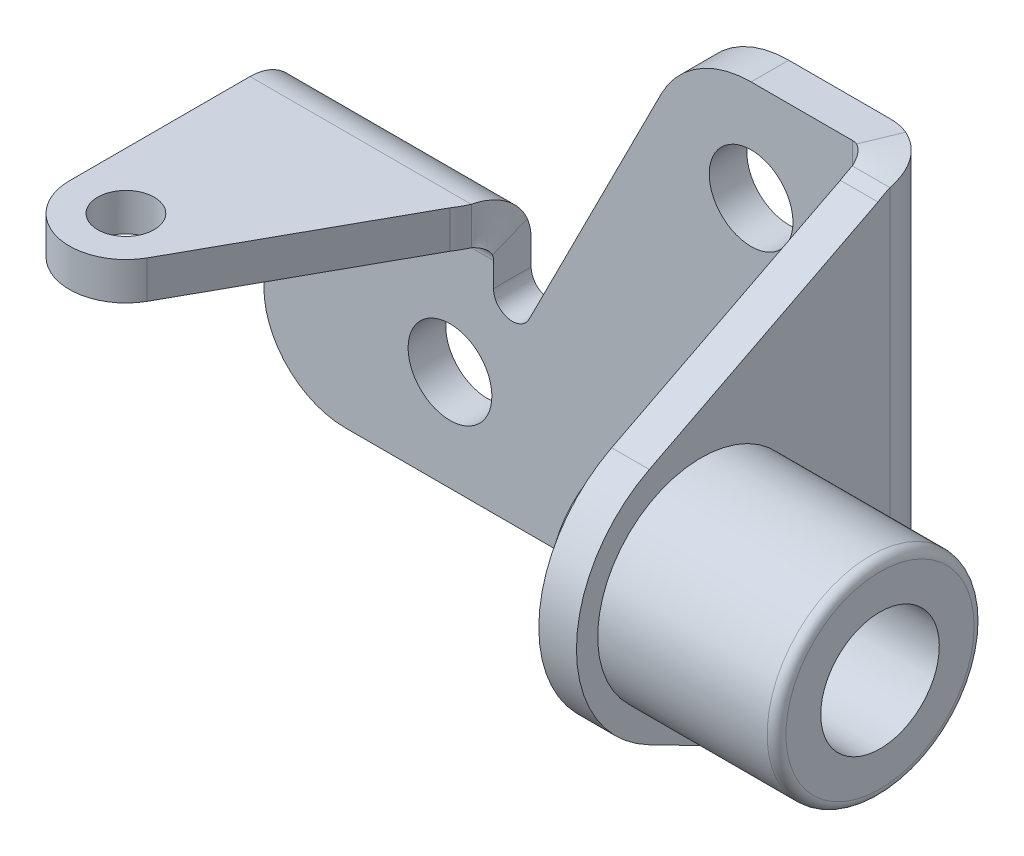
ISO-10303-21;
HEADER;
FILE_DESCRIPTION(('STEP AP214'),'2;1');
FILE_NAME('part.step','',(''),(''),'','','');
FILE_SCHEMA(('AUTOMOTIVE_DESIGN { 1 0 10303 214 1 1 1 1 }'));
ENDSEC;
DATA;
#1=APPLICATION_CONTEXT('core data for automotive mechanical design processes');
#2=APPLICATION_PROTOCOL_DEFINITION('international standard','automotive_design',2000,#1);
#3=PRODUCT_CONTEXT('',#1,'mechanical');
#4=PRODUCT('Part','Part','',(#3));
#5=PRODUCT_RELATED_PRODUCT_CATEGORY('part','',(#4));
#6=PRODUCT_DEFINITION_FORMATION('','',#4);
#7=PRODUCT_DEFINITION_CONTEXT('part definition',#1,'design');
#8=PRODUCT_DEFINITION('design','',#6,#7);
#9=PRODUCT_DEFINITION_SHAPE('','',#8);
#10=(LENGTH_UNIT() NAMED_UNIT(*) SI_UNIT(.MILLI.,.METRE.));
#11=(NAMED_UNIT(*) PLANE_ANGLE_UNIT() SI_UNIT($,.RADIAN.));
#12=(NAMED_UNIT(*) SI_UNIT($,.STERADIAN.) SOLID_ANGLE_UNIT());
#13=UNCERTAINTY_MEASURE_WITH_UNIT(LENGTH_MEASURE(1.E-05),#10,'distance_accuracy_value','');
#14=(GEOMETRIC_REPRESENTATION_CONTEXT(3) GLOBAL_UNCERTAINTY_ASSIGNED_CONTEXT((#13)) GLOBAL_UNIT_ASSIGNED_CONTEXT((#10,
#11,#12)) REPRESENTATION_CONTEXT('',''));
#15=CARTESIAN_POINT('',(0.,0.,0.));
#16=DIRECTION('',(0.,0.,1.));
#17=DIRECTION('',(1.,0.,0.));
#18=AXIS2_PLACEMENT_3D('',#15,#16,#17);
#19=CARTESIAN_POINT('',(33.6135886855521,8.,12.7635262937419));
#20=DIRECTION('',(1.,0.,0.));
#21=DIRECTION('',(0.,0.214722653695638,0.976675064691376));
#22=AXIS2_PLACEMENT_3D('',#19,#20,#21);
#23=PLANE('',#22);
#24=CARTESIAN_POINT('',(33.6135886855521,8.,12.7635262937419));
#25=DIRECTION('',(1.,0.,0.));
#26=DIRECTION('',(0.,0.976675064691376,-0.214722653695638));
#27=AXIS2_PLACEMENT_3D('',#24,#25,#26);
#28=CIRCLE('',#27,5.00000000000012);
#29=CARTESIAN_POINT('',(33.6135886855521,12.883375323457,11.6899130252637));
#30=VERTEX_POINT('',#29);
#31=EDGE_CURVE('E1621',#30,#30,#28,.T.);
#32=ORIENTED_EDGE('',*,*,#31,.T.);
#33=EDGE_LOOP('',(#32));
#34=FACE_BOUND('',#33,.T.);
#35=CARTESIAN_POINT('',(33.6135886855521,8.,12.7635262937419));
#36=DIRECTION('',(1.,0.,0.));
#37=DIRECTION('',(0.,0.976675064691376,-0.214722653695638));
#38=AXIS2_PLACEMENT_3D('',#35,#36,#37);
#39=CIRCLE('',#38,3.15000000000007);
#40=CARTESIAN_POINT('',(33.6135886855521,11.0765264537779,12.0871499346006));
#41=VERTEX_POINT('',#40);
#42=EDGE_CURVE('E27',#41,#41,#39,.T.);
#43=ORIENTED_EDGE('',*,*,#42,.F.);
#44=EDGE_LOOP('',(#43));
#45=FACE_BOUND('',#44,.T.);
#46=ADVANCED_FACE('F16',(#34,#45),#23,.T.);
#47=CARTESIAN_POINT('',(33.1135886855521,8.,12.7635262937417));
#48=DIRECTION('',(1.,0.,0.));
#49=DIRECTION('',(0.,0.976675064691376,-0.214722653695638));
#50=AXIS2_PLACEMENT_3D('',#47,#48,#49);
#51=TOROIDAL_SURFACE('',#50,5.,0.5);
#52=ORIENTED_EDGE('',*,*,#31,.F.);
#53=EDGE_LOOP('',(#52));
#54=FACE_BOUND('',#53,.T.);
#55=CARTESIAN_POINT('',(33.1135886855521,8.,12.7635262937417));
#56=DIRECTION('',(-1.,0.,0.));
#57=DIRECTION('',(0.,0.976675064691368,-0.214722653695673));
#58=AXIS2_PLACEMENT_3D('',#55,#56,#57);
#59=CIRCLE('',#58,5.50000000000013);
#60=CARTESIAN_POINT('',(33.1135886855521,13.3717128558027,11.5825516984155));
#61=VERTEX_POINT('',#60);
#62=EDGE_CURVE('E1607',#61,#61,#59,.T.);
#63=ORIENTED_EDGE('',*,*,#62,.F.);
#64=EDGE_LOOP('',(#63));
#65=FACE_BOUND('',#64,.T.);
#66=ADVANCED_FACE('F1526',(#54,#65),#51,.T.);
#67=CARTESIAN_POINT('',(33.6135886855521,8.,12.7635262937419));
#68=DIRECTION('',(-1.,0.,0.));
#69=DIRECTION('',(0.,-0.976675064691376,0.214722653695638));
#70=AXIS2_PLACEMENT_3D('',#67,#68,#69);
#71=CYLINDRICAL_SURFACE('',#70,5.50000000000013);
#72=CARTESIAN_POINT('',(24.1135886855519,8.,12.7635262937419));
#73=DIRECTION('',(1.,0.,0.));
#74=DIRECTION('',(0.,0.976675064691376,-0.214722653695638));
#75=AXIS2_PLACEMENT_3D('',#72,#73,#74);
#76=CIRCLE('',#75,5.50000000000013);
#77=CARTESIAN_POINT('',(24.1135886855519,13.3717128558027,11.5825516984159));
#78=VERTEX_POINT('',#77);
#79=EDGE_CURVE('E876',#78,#78,#76,.T.);
#80=ORIENTED_EDGE('',*,*,#79,.T.);
#81=EDGE_LOOP('',(#80));
#82=FACE_BOUND('',#81,.T.);
#83=ORIENTED_EDGE('',*,*,#62,.T.);
#84=EDGE_LOOP('',(#83));
#85=FACE_BOUND('',#84,.T.);
#86=ADVANCED_FACE('F1520',(#82,#85),#71,.T.);
#87=CARTESIAN_POINT('',(33.6135886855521,8.,12.7635262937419));
#88=DIRECTION('',(-1.,0.,0.));
#89=DIRECTION('',(0.,-0.976675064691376,0.214722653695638));
#90=AXIS2_PLACEMENT_3D('',#87,#88,#89);
#91=CYLINDRICAL_SURFACE('',#90,3.15000000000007);
#92=CARTESIAN_POINT('',(20.1135886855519,8.,12.763526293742));
#93=DIRECTION('',(-1.,0.,0.));
#94=DIRECTION('',(0.,-0.976675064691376,0.214722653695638));
#95=AXIS2_PLACEMENT_3D('',#92,#93,#94);
#96=CIRCLE('',#95,3.15000000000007);
#97=CARTESIAN_POINT('',(20.1135886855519,4.92347354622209,13.4399026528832));
#98=VERTEX_POINT('',#97);
#99=EDGE_CURVE('E1603',#98,#98,#96,.T.);
#100=ORIENTED_EDGE('',*,*,#99,.T.);
#101=EDGE_LOOP('',(#100));
#102=FACE_BOUND('',#101,.T.);
#103=ORIENTED_EDGE('',*,*,#42,.T.);
#104=EDGE_LOOP('',(#103));
#105=FACE_BOUND('',#104,.T.);
#106=ADVANCED_FACE('F1525',(#102,#105),#91,.F.);
#107=CARTESIAN_POINT('',(20.1135886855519,8.,12.763526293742));
#108=DIRECTION('',(-1.,0.,0.));
#109=DIRECTION('',(0.,0.214722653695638,0.976675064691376));
#110=AXIS2_PLACEMENT_3D('',#107,#108,#109);
#111=PLANE('',#110);
#112=CARTESIAN_POINT('',(20.1135886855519,8.,12.763526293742));
#113=DIRECTION('',(-1.,0.,0.));
#114=DIRECTION('',(0.,-0.976675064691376,0.214722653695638));
#115=AXIS2_PLACEMENT_3D('',#112,#113,#114);
#116=CIRCLE('',#115,4.0000000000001);
#117=CARTESIAN_POINT('',(20.1135886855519,4.0932997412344,13.6224169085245));
#118=VERTEX_POINT('',#117);
#119=EDGE_CURVE('E297',#118,#118,#116,.T.);
#120=ORIENTED_EDGE('',*,*,#119,.T.);
#121=EDGE_LOOP('',(#120));
#122=FACE_BOUND('',#121,.T.);
#123=ORIENTED_EDGE('',*,*,#99,.F.);
#124=EDGE_LOOP('',(#123));
#125=FACE_BOUND('',#124,.T.);
#126=ADVANCED_FACE('F1538',(#122,#125),#111,.T.);
#127=CARTESIAN_POINT('',(20.1135886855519,8.,12.763526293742));
#128=DIRECTION('',(1.,0.,0.));
#129=DIRECTION('',(0.,0.976675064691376,-0.214722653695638));
#130=AXIS2_PLACEMENT_3D('',#127,#128,#129);
#131=CYLINDRICAL_SURFACE('',#130,4.0000000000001);
#132=CARTESIAN_POINT('',(22.113588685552,8.,12.763526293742));
#133=DIRECTION('',(1.,0.,0.));
#134=DIRECTION('',(0.,0.,-1.));
#135=AXIS2_PLACEMENT_3D('',#132,#133,#134);
#136=CIRCLE('',#135,4.0000000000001);
#137=CARTESIAN_POINT('',(22.113588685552,8.,8.76352629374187));
#138=VERTEX_POINT('',#137);
#139=EDGE_CURVE('E10',#138,#138,#136,.F.);
#140=ORIENTED_EDGE('',*,*,#139,.T.);
#141=EDGE_LOOP('',(#140));
#142=FACE_BOUND('',#141,.T.);
#143=ORIENTED_EDGE('',*,*,#119,.F.);
#144=EDGE_LOOP('',(#143));
#145=FACE_BOUND('',#144,.T.);
#146=ADVANCED_FACE('F1220',(#142,#145),#131,.T.);
#147=CARTESIAN_POINT('',(-6.88595321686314,9.02267754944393,12.3336970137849));
#148=DIRECTION('',(0.,1.,0.));
#149=DIRECTION('',(1.,0.,0.));
#150=AXIS2_PLACEMENT_3D('',#147,#148,#149);
#151=CYLINDRICAL_SURFACE('',#150,1.5);
#152=CARTESIAN_POINT('',(-6.88595321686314,9.02267754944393,12.3336970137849));
#153=DIRECTION('',(0.,1.,0.));
#154=DIRECTION('',(1.,0.,0.));
#155=AXIS2_PLACEMENT_3D('',#152,#153,#154);
#156=CIRCLE('',#155,1.5);
#157=CARTESIAN_POINT('',(-5.38595321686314,9.02267754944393,12.3336970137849));
#158=VERTEX_POINT('',#157);
#159=EDGE_CURVE('E293',#158,#158,#156,.T.);
#160=ORIENTED_EDGE('',*,*,#159,.T.);
#161=EDGE_LOOP('',(#160));
#162=FACE_BOUND('',#161,.T.);
#163=CARTESIAN_POINT('',(-6.88595321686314,7.02267754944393,12.3336970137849));
#164=DIRECTION('',(0.,1.,0.));
#165=DIRECTION('',(0.,0.,-1.));
#166=AXIS2_PLACEMENT_3D('',#163,#164,#165);
#167=CIRCLE('',#166,1.5);
#168=CARTESIAN_POINT('',(-6.88595321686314,7.02267754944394,10.8336970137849));
#169=VERTEX_POINT('',#168);
#170=EDGE_CURVE('E608',#169,#169,#167,.T.);
#171=ORIENTED_EDGE('',*,*,#170,.F.);
#172=EDGE_LOOP('',(#171));
#173=FACE_BOUND('',#172,.T.);
#174=ADVANCED_FACE('F449',(#162,#173),#151,.F.);
#175=CARTESIAN_POINT('',(-6.88595321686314,7.02267754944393,12.3336970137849));
#176=DIRECTION('',(0.,1.,0.));
#177=DIRECTION('',(0.,0.,-1.));
#178=AXIS2_PLACEMENT_3D('',#175,#176,#177);
#179=CYLINDRICAL_SURFACE('',#178,3.00337457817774);
#180=CARTESIAN_POINT('',(-6.88595321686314,9.02267754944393,12.3336970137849));
#181=DIRECTION('',(0.,1.,0.));
#182=DIRECTION('',(0.,0.,-1.));
#183=AXIS2_PLACEMENT_3D('',#180,#181,#182);
#184=CIRCLE('',#183,3.00337457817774);
#185=CARTESIAN_POINT('',(-9.8890888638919,9.02267754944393,12.3715802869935));
#186=VERTEX_POINT('',#185);
#187=CARTESIAN_POINT('',(-4.27700130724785,9.02267754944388,13.8215238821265));
#188=VERTEX_POINT('',#187);
#189=EDGE_CURVE('E286',#186,#188,#184,.T.);
#190=ORIENTED_EDGE('',*,*,#189,.F.);
#191=DIRECTION('',(0.,1.,0.));
#192=VECTOR('',#191,1.);
#193=CARTESIAN_POINT('',(-9.8890888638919,7.02267754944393,12.3715802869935));
#194=LINE('',#193,#192);
#195=CARTESIAN_POINT('',(-9.8890888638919,7.02267754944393,12.3715802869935));
#196=VERTEX_POINT('',#195);
#197=EDGE_CURVE('E299',#196,#186,#194,.T.);
#198=ORIENTED_EDGE('',*,*,#197,.F.);
#199=CARTESIAN_POINT('',(-6.88595321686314,7.02267754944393,12.3336970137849));
#200=DIRECTION('',(0.,1.,0.));
#201=DIRECTION('',(0.,0.,-1.));
#202=AXIS2_PLACEMENT_3D('',#199,#200,#201);
#203=CIRCLE('',#202,3.00337457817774);
#204=CARTESIAN_POINT('',(-4.27700130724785,7.02267754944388,13.8215238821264));
#205=VERTEX_POINT('',#204);
#206=EDGE_CURVE('E643',#196,#205,#203,.T.);
#207=ORIENTED_EDGE('',*,*,#206,.T.);
#208=DIRECTION('',(0.,1.,0.));
#209=VECTOR('',#208,1.);
#210=CARTESIAN_POINT('',(-4.27700130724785,7.02267754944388,13.8215238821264));
#211=LINE('',#210,#209);
#212=EDGE_CURVE('E639',#205,#188,#211,.T.);
#213=ORIENTED_EDGE('',*,*,#212,.T.);
#214=EDGE_LOOP('',(#190,#198,#207,#213));
#215=FACE_BOUND('',#214,.T.);
#216=ADVANCED_FACE('F580',(#215),#179,.T.);
#217=CARTESIAN_POINT('',(1.4646320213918,7.02267754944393,3.46609406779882));
#218=DIRECTION('',(0.874565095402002,0.,0.484908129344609));
#219=DIRECTION('',(0.484908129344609,0.,-0.874565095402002));
#220=AXIS2_PLACEMENT_3D('',#217,#218,#219);
#221=PLANE('',#220);
#222=DIRECTION('',(0.484908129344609,0.,-0.874565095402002));
#223=VECTOR('',#222,1.);
#224=CARTESIAN_POINT('',(1.4646320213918,9.02267754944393,3.46609406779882));
#225=LINE('',#224,#223);
#226=CARTESIAN_POINT('',(1.4646320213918,9.02267754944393,3.46609406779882));
#227=VERTEX_POINT('',#226);
#228=EDGE_CURVE('E290',#188,#227,#225,.T.);
#229=ORIENTED_EDGE('',*,*,#228,.F.);
#230=ORIENTED_EDGE('',*,*,#212,.F.);
#231=DIRECTION('',(0.484908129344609,0.,-0.874565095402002));
#232=VECTOR('',#231,1.);
#233=CARTESIAN_POINT('',(1.4646320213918,7.02267754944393,3.46609406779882));
#234=LINE('',#233,#232);
#235=CARTESIAN_POINT('',(1.4646320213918,7.02267754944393,3.46609406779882));
#236=VERTEX_POINT('',#235);
#237=EDGE_CURVE('E334',#205,#236,#234,.T.);
#238=ORIENTED_EDGE('',*,*,#237,.T.);
#239=DIRECTION('',(0.,1.,0.));
#240=VECTOR('',#239,1.);
#241=CARTESIAN_POINT('',(1.4646320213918,7.02267754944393,3.46609406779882));
#242=LINE('',#241,#240);
#243=EDGE_CURVE('E330',#236,#227,#242,.T.);
#244=ORIENTED_EDGE('',*,*,#243,.T.);
#245=EDGE_LOOP('',(#229,#230,#238,#244));
#246=FACE_BOUND('',#245,.T.);
#247=ADVANCED_FACE('F1475',(#246),#221,.T.);
#248=CARTESIAN_POINT('',(-2.69291657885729,7.02267754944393,0.678431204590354));
#249=DIRECTION('',(0.,1.,0.));
#250=DIRECTION('',(0.,0.,-1.));
#251=AXIS2_PLACEMENT_3D('',#248,#249,#250);
#252=CYLINDRICAL_SURFACE('',#251,5.00562429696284);
#253=CARTESIAN_POINT('',(1.87000088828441,9.02267754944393,2.7366));
#254=CARTESIAN_POINT('',(1.87000088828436,7.02267754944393,2.7366));
#255=(BOUNDED_CURVE() B_SPLINE_CURVE(1,(#253,#254),.UNSPECIFIED.,.F.,
.F.) B_SPLINE_CURVE_WITH_KNOTS((2,2),(0.,1.),
.UNSPECIFIED.) CURVE() GEOMETRIC_REPRESENTATION_ITEM() RATIONAL_B_SPLINE_CURVE((1.,1.)) REPRESENTATION_ITEM(''));
#256=CARTESIAN_POINT('',(1.87000088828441,9.02267754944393,2.7366));
#257=VERTEX_POINT('',#256);
#258=CARTESIAN_POINT('',(1.87000088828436,7.02267754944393,2.7366));
#259=VERTEX_POINT('',#258);
#260=EDGE_CURVE('E829',#257,#259,#255,.T.);
#261=ORIENTED_EDGE('',*,*,#260,.F.);
#262=CARTESIAN_POINT('',(-2.69291657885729,9.02267754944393,0.678431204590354));
#263=DIRECTION('',(0.,1.,0.));
#264=DIRECTION('',(0.,0.,-1.));
#265=AXIS2_PLACEMENT_3D('',#262,#263,#264);
#266=CIRCLE('',#265,5.00562429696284);
#267=EDGE_CURVE('E311',#227,#257,#266,.T.);
#268=ORIENTED_EDGE('',*,*,#267,.F.);
#269=ORIENTED_EDGE('',*,*,#243,.F.);
#270=CARTESIAN_POINT('',(-2.69291657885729,7.02267754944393,0.678431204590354));
#271=DIRECTION('',(0.,1.,0.));
#272=DIRECTION('',(0.,0.,-1.));
#273=AXIS2_PLACEMENT_3D('',#270,#271,#272);
#274=CIRCLE('',#273,5.00562429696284);
#275=EDGE_CURVE('E610',#236,#259,#274,.T.);
#276=ORIENTED_EDGE('',*,*,#275,.T.);
#277=EDGE_LOOP('',(#261,#268,#269,#276));
#278=FACE_BOUND('',#277,.T.);
#279=ADVANCED_FACE('F1485',(#278),#252,.T.);
#280=CARTESIAN_POINT('',(-6.88595321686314,9.02267754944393,12.3336970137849));
#281=DIRECTION('',(0.,1.,0.));
#282=DIRECTION('',(0.,0.,1.));
#283=AXIS2_PLACEMENT_3D('',#280,#281,#282);
#284=PLANE('',#283);
#285=DIRECTION('',(1.,0.,0.));
#286=VECTOR('',#285,1.);
#287=CARTESIAN_POINT('',(-6.88595321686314,9.02267754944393,2.7366));
#288=LINE('',#287,#286);
#289=CARTESIAN_POINT('',(-9.88908886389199,9.02267754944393,2.7366));
#290=VERTEX_POINT('',#289);
#291=EDGE_CURVE('E161',#290,#257,#288,.T.);
#292=ORIENTED_EDGE('',*,*,#291,.F.);
#293=DIRECTION('',(0.,0.,1.));
#294=VECTOR('',#293,1.);
#295=CARTESIAN_POINT('',(-9.8890888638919,9.02267754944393,12.3715802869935));
#296=LINE('',#295,#294);
#297=EDGE_CURVE('E289',#290,#186,#296,.T.);
#298=ORIENTED_EDGE('',*,*,#297,.T.);
#299=ORIENTED_EDGE('',*,*,#189,.T.);
#300=ORIENTED_EDGE('',*,*,#228,.T.);
#301=ORIENTED_EDGE('',*,*,#267,.T.);
#302=EDGE_LOOP('',(#292,#298,#299,#300,#301));
#303=FACE_BOUND('',#302,.T.);
#304=ORIENTED_EDGE('',*,*,#159,.F.);
#305=EDGE_LOOP('',(#304));
#306=FACE_BOUND('',#305,.T.);
#307=ADVANCED_FACE('F889',(#303,#306),#284,.T.);
#308=CARTESIAN_POINT('',(-6.88595321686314,7.02267754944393,12.3336970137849));
#309=DIRECTION('',(0.,1.,0.));
#310=DIRECTION('',(0.,0.,1.));
#311=AXIS2_PLACEMENT_3D('',#308,#309,#310);
#312=PLANE('',#311);
#313=DIRECTION('',(0.,0.,1.));
#314=VECTOR('',#313,1.);
#315=CARTESIAN_POINT('',(-9.8890888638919,7.02267754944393,12.3715802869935));
#316=LINE('',#315,#314);
#317=CARTESIAN_POINT('',(-9.88908886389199,7.02267754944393,2.7366));
#318=VERTEX_POINT('',#317);
#319=EDGE_CURVE('E301',#318,#196,#316,.T.);
#320=ORIENTED_EDGE('',*,*,#319,.F.);
#321=DIRECTION('',(1.,0.,0.));
#322=VECTOR('',#321,1.);
#323=CARTESIAN_POINT('',(-6.88595321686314,7.02267754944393,2.7366));
#324=LINE('',#323,#322);
#325=EDGE_CURVE('E170',#318,#259,#324,.T.);
#326=ORIENTED_EDGE('',*,*,#325,.T.);
#327=ORIENTED_EDGE('',*,*,#275,.F.);
#328=ORIENTED_EDGE('',*,*,#237,.F.);
#329=ORIENTED_EDGE('',*,*,#206,.F.);
#330=EDGE_LOOP('',(#320,#326,#327,#328,#329));
#331=FACE_BOUND('',#330,.T.);
#332=ORIENTED_EDGE('',*,*,#170,.T.);
#333=EDGE_LOOP('',(#332));
#334=FACE_BOUND('',#333,.T.);
#335=ADVANCED_FACE('F577',(#331,#334),#312,.F.);
#336=CARTESIAN_POINT('',(2.31270771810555,7.31541726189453,0.200966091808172));
#337=CARTESIAN_POINT('',(2.29912517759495,7.78219393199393,0.390453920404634));
#338=CARTESIAN_POINT('',(2.25541510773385,8.21465086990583,0.721212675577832));
#339=CARTESIAN_POINT('',(2.1078461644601,8.83610026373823,1.60586339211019));
#340=CARTESIAN_POINT('',(2.00436118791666,9.02267754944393,2.1582295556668));
#341=CARTESIAN_POINT('',(1.87000088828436,9.02267754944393,2.7366));
#342=CARTESIAN_POINT('',(2.31270771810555,6.56314092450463,2.05409326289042));
#343=CARTESIAN_POINT('',(2.29912501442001,6.68878289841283,2.10509757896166));
#344=CARTESIAN_POINT('',(2.25541510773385,6.80518414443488,2.19412601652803));
#345=CARTESIAN_POINT('',(2.1078461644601,6.97245726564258,2.43224401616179));
#346=CARTESIAN_POINT('',(2.00420612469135,7.02267754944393,2.58110193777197));
#347=CARTESIAN_POINT('',(1.87000088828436,7.02267754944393,2.7366));
#348=(BOUNDED_SURFACE() B_SPLINE_SURFACE(1,3,((#336,#337,#338,#339,#340,#341),(#342,#343,#344,
#345,#346,#347)),.UNSPECIFIED.,.F.,.F.,.F.) B_SPLINE_SURFACE_WITH_KNOTS((2,2),(4,2,4),(0.,1.),
(0.,0.5,1.),.UNSPECIFIED.) GEOMETRIC_REPRESENTATION_ITEM() RATIONAL_B_SPLINE_SURFACE(((1.,1.,1.,
1.,1.,1.),(1.,1.,1.,1.,1.,1.))) REPRESENTATION_ITEM('') SURFACE());
#349=CARTESIAN_POINT('',(2.31270771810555,7.31541726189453,0.200966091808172));
#350=CARTESIAN_POINT('',(2.31270771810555,7.06465848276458,0.818675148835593));
#351=CARTESIAN_POINT('',(2.31270771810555,6.81389970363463,1.43638420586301));
#352=CARTESIAN_POINT('',(2.31270771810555,6.56314092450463,2.05409326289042));
#353=(BOUNDED_CURVE() B_SPLINE_CURVE(3,(#349,#350,#351,#352),.UNSPECIFIED.,.F.,
.F.) B_SPLINE_CURVE_WITH_KNOTS((4,4),(0.,1.),
.UNSPECIFIED.) CURVE() GEOMETRIC_REPRESENTATION_ITEM() RATIONAL_B_SPLINE_CURVE((1.,1.,1.,1.)) REPRESENTATION_ITEM(''));
#354=CARTESIAN_POINT('',(2.31270771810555,7.31541726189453,0.200966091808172));
#355=VERTEX_POINT('',#354);
#356=CARTESIAN_POINT('',(2.31270771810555,6.56314092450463,2.05409326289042));
#357=VERTEX_POINT('',#356);
#358=EDGE_CURVE('E817',#355,#357,#353,.T.);
#359=CARTESIAN_POINT('',(2.31270771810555,7.31541726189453,0.200966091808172));
#360=CARTESIAN_POINT('',(2.29912517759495,7.78219393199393,0.390453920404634));
#361=CARTESIAN_POINT('',(2.25541510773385,8.21465086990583,0.721212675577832));
#362=CARTESIAN_POINT('',(2.1078461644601,8.83610026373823,1.60586339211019));
#363=CARTESIAN_POINT('',(2.00436118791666,9.02267754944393,2.1582295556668));
#364=CARTESIAN_POINT('',(1.87000088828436,9.02267754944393,2.7366));
#365=(BOUNDED_CURVE() B_SPLINE_CURVE(3,(#359,#360,#361,#362,#363,#364),.UNSPECIFIED.,.F.,
.F.) B_SPLINE_CURVE_WITH_KNOTS((4,2,4),(0.,0.5,1.),
.UNSPECIFIED.) CURVE() GEOMETRIC_REPRESENTATION_ITEM() RATIONAL_B_SPLINE_CURVE((1.,1.,1.,1.,1.,1.)) REPRESENTATION_ITEM(''));
#366=EDGE_CURVE('E558',#355,#257,#365,.T.);
#367=CARTESIAN_POINT('',(1.87000088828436,7.02267754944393,2.7366));
#368=CARTESIAN_POINT('',(2.00420612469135,7.02267754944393,2.58110193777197));
#369=CARTESIAN_POINT('',(2.1078461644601,6.97245726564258,2.43224401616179));
#370=CARTESIAN_POINT('',(2.25541510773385,6.80518414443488,2.19412601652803));
#371=CARTESIAN_POINT('',(2.29912501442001,6.68878289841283,2.10509757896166));
#372=CARTESIAN_POINT('',(2.31270771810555,6.56314092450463,2.05409326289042));
#373=(BOUNDED_CURVE() B_SPLINE_CURVE(3,(#367,#368,#369,#370,#371,#372),.UNSPECIFIED.,.F.,
.F.) B_SPLINE_CURVE_WITH_KNOTS((4,2,4),(0.,0.5,1.),
.UNSPECIFIED.) CURVE() GEOMETRIC_REPRESENTATION_ITEM() RATIONAL_B_SPLINE_CURVE((1.,1.,1.,1.,1.,1.)) REPRESENTATION_ITEM(''));
#374=EDGE_CURVE('E704',#357,#259,#373,.F.);
#375=ORIENTED_EDGE('',*,*,#358,.F.);
#376=ORIENTED_EDGE('',*,*,#366,.T.);
#377=ORIENTED_EDGE('',*,*,#260,.T.);
#378=ORIENTED_EDGE('',*,*,#374,.F.);
#379=EDGE_LOOP('',(#375,#376,#377,#378));
#380=FACE_BOUND('',#379,.T.);
#381=ADVANCED_FACE('F564',(#380),#348,.F.);
#382=CARTESIAN_POINT('',(8.8737594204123,6.28607754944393,2.7366));
#383=DIRECTION('',(-1.,0.,0.));
#384=DIRECTION('',(0.,1.,0.));
#385=AXIS2_PLACEMENT_3D('',#382,#383,#384);
#386=CYLINDRICAL_SURFACE('',#385,2.7366);
#387=ORIENTED_EDGE('',*,*,#366,.F.);
#388=CARTESIAN_POINT('',(2.31270771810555,6.28607754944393,2.7366));
#389=DIRECTION('',(1.,0.,0.));
#390=DIRECTION('',(0.,1.,0.));
#391=AXIS2_PLACEMENT_3D('',#388,#389,#390);
#392=CIRCLE('',#391,2.7366);
#393=CARTESIAN_POINT('',(2.31270771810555,6.28607754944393,0.));
#394=VERTEX_POINT('',#393);
#395=EDGE_CURVE('E315',#394,#355,#392,.T.);
#396=ORIENTED_EDGE('',*,*,#395,.F.);
#397=DIRECTION('',(1.,0.,0.));
#398=VECTOR('',#397,1.);
#399=CARTESIAN_POINT('',(-6.88595321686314,6.28607754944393,0.));
#400=LINE('',#399,#398);
#401=CARTESIAN_POINT('',(-9.88908886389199,6.28607754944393,0.));
#402=VERTEX_POINT('',#401);
#403=EDGE_CURVE('E241',#402,#394,#400,.T.);
#404=ORIENTED_EDGE('',*,*,#403,.F.);
#405=CARTESIAN_POINT('',(-9.88908886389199,6.28607754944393,2.7366));
#406=DIRECTION('',(-1.,0.,0.));
#407=DIRECTION('',(0.,1.,0.));
#408=AXIS2_PLACEMENT_3D('',#405,#406,#407);
#409=CIRCLE('',#408,2.7366);
#410=EDGE_CURVE('E236',#290,#402,#409,.T.);
#411=ORIENTED_EDGE('',*,*,#410,.F.);
#412=ORIENTED_EDGE('',*,*,#291,.T.);
#413=EDGE_LOOP('',(#387,#396,#404,#411,#412));
#414=FACE_BOUND('',#413,.T.);
#415=ADVANCED_FACE('F576',(#414),#386,.T.);
#416=CARTESIAN_POINT('',(16.,16.,1.99999999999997));
#417=DIRECTION('',(0.,0.,-1.));
#418=DIRECTION('',(0.,-1.,0.));
#419=AXIS2_PLACEMENT_3D('',#416,#417,#418);
#420=CYLINDRICAL_SURFACE('',#419,2.225);
#421=CARTESIAN_POINT('',(16.,16.,0.));
#422=DIRECTION('',(0.,0.,-1.));
#423=DIRECTION('',(0.,-1.,0.));
#424=AXIS2_PLACEMENT_3D('',#421,#422,#423);
#425=CIRCLE('',#424,2.225);
#426=CARTESIAN_POINT('',(16.,13.775,0.));
#427=VERTEX_POINT('',#426);
#428=EDGE_CURVE('E691',#427,#427,#425,.T.);
#429=ORIENTED_EDGE('',*,*,#428,.T.);
#430=EDGE_LOOP('',(#429));
#431=FACE_BOUND('',#430,.T.);
#432=CARTESIAN_POINT('',(16.,16.,1.99999999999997));
#433=DIRECTION('',(0.,0.,-1.));
#434=DIRECTION('',(0.,-1.,0.));
#435=AXIS2_PLACEMENT_3D('',#432,#433,#434);
#436=CIRCLE('',#435,2.225);
#437=CARTESIAN_POINT('',(16.,13.775,1.99999999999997));
#438=VERTEX_POINT('',#437);
#439=EDGE_CURVE('E340',#438,#438,#436,.T.);
#440=ORIENTED_EDGE('',*,*,#439,.F.);
#441=EDGE_LOOP('',(#440));
#442=FACE_BOUND('',#441,.T.);
#443=ADVANCED_FACE('F1250',(#431,#442),#420,.F.);
#444=CARTESIAN_POINT('',(16.,0.,1.99999999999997));
#445=DIRECTION('',(0.,0.,-1.));
#446=DIRECTION('',(0.,-1.,0.));
#447=AXIS2_PLACEMENT_3D('',#444,#445,#446);
#448=CYLINDRICAL_SURFACE('',#447,2.225);
#449=CARTESIAN_POINT('',(16.,0.,0.));
#450=DIRECTION('',(0.,0.,-1.));
#451=DIRECTION('',(0.,-1.,0.));
#452=AXIS2_PLACEMENT_3D('',#449,#450,#451);
#453=CIRCLE('',#452,2.225);
#454=CARTESIAN_POINT('',(16.,-2.22500000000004,0.));
#455=VERTEX_POINT('',#454);
#456=EDGE_CURVE('E344',#455,#455,#453,.T.);
#457=ORIENTED_EDGE('',*,*,#456,.T.);
#458=EDGE_LOOP('',(#457));
#459=FACE_BOUND('',#458,.T.);
#460=CARTESIAN_POINT('',(16.,0.,1.99999999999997));
#461=DIRECTION('',(0.,0.,-1.));
#462=DIRECTION('',(0.,-1.,0.));
#463=AXIS2_PLACEMENT_3D('',#460,#461,#462);
#464=CIRCLE('',#463,2.225);
#465=CARTESIAN_POINT('',(16.,-2.22500000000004,1.99999999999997));
#466=VERTEX_POINT('',#465);
#467=EDGE_CURVE('E335',#466,#466,#464,.T.);
#468=ORIENTED_EDGE('',*,*,#467,.F.);
#469=EDGE_LOOP('',(#468));
#470=FACE_BOUND('',#469,.T.);
#471=ADVANCED_FACE('F1240',(#459,#470),#448,.F.);
#472=CARTESIAN_POINT('',(0.,0.,2.));
#473=DIRECTION('',(0.,0.,-1.));
#474=DIRECTION('',(0.,-1.,0.));
#475=AXIS2_PLACEMENT_3D('',#472,#473,#474);
#476=CYLINDRICAL_SURFACE('',#475,2.225);
#477=CARTESIAN_POINT('',(0.,0.,0.));
#478=DIRECTION('',(0.,0.,-1.));
#479=DIRECTION('',(0.,-1.,0.));
#480=AXIS2_PLACEMENT_3D('',#477,#478,#479);
#481=CIRCLE('',#480,2.225);
#482=CARTESIAN_POINT('',(0.,-2.225,0.));
#483=VERTEX_POINT('',#482);
#484=EDGE_CURVE('E298',#483,#483,#481,.T.);
#485=ORIENTED_EDGE('',*,*,#484,.T.);
#486=EDGE_LOOP('',(#485));
#487=FACE_BOUND('',#486,.T.);
#488=CARTESIAN_POINT('',(0.,0.,2.));
#489=DIRECTION('',(0.,0.,-1.));
#490=DIRECTION('',(0.,-1.,0.));
#491=AXIS2_PLACEMENT_3D('',#488,#489,#490);
#492=CIRCLE('',#491,2.225);
#493=CARTESIAN_POINT('',(0.,-2.225,2.));
#494=VERTEX_POINT('',#493);
#495=EDGE_CURVE('E339',#494,#494,#492,.T.);
#496=ORIENTED_EDGE('',*,*,#495,.F.);
#497=EDGE_LOOP('',(#496));
#498=FACE_BOUND('',#497,.T.);
#499=ADVANCED_FACE('F528',(#487,#498),#476,.F.);
#500=CARTESIAN_POINT('',(2.31270771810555,4.99113920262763,2.));
#501=DIRECTION('',(1.,0.,0.));
#502=DIRECTION('',(0.,-1.,0.));
#503=AXIS2_PLACEMENT_3D('',#500,#501,#502);
#504=PLANE('',#503);
#505=DIRECTION('',(0.,-1.,0.));
#506=VECTOR('',#505,1.);
#507=CARTESIAN_POINT('',(2.31270771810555,4.99113920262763,0.));
#508=LINE('',#507,#506);
#509=CARTESIAN_POINT('',(2.31270771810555,4.99113920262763,0.));
#510=VERTEX_POINT('',#509);
#511=EDGE_CURVE('E347',#394,#510,#508,.T.);
#512=ORIENTED_EDGE('',*,*,#511,.F.);
#513=ORIENTED_EDGE('',*,*,#395,.T.);
#514=ORIENTED_EDGE('',*,*,#358,.T.);
#515=CARTESIAN_POINT('',(2.31270771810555,6.28607754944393,2.7366));
#516=DIRECTION('',(1.,0.,0.));
#517=DIRECTION('',(0.,1.,0.));
#518=AXIS2_PLACEMENT_3D('',#515,#516,#517);
#519=CIRCLE('',#518,0.7366);
#520=CARTESIAN_POINT('',(2.31270771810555,6.28607754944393,2.));
#521=VERTEX_POINT('',#520);
#522=EDGE_CURVE('E595',#521,#357,#519,.T.);
#523=ORIENTED_EDGE('',*,*,#522,.F.);
#524=DIRECTION('',(0.,-1.,0.));
#525=VECTOR('',#524,1.);
#526=CARTESIAN_POINT('',(2.31270771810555,4.99113920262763,2.));
#527=LINE('',#526,#525);
#528=CARTESIAN_POINT('',(2.31270771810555,4.99113920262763,2.));
#529=VERTEX_POINT('',#528);
#530=EDGE_CURVE('E655',#521,#529,#527,.T.);
#531=ORIENTED_EDGE('',*,*,#530,.T.);
#532=DIRECTION('',(0.,0.,-1.));
#533=VECTOR('',#532,1.);
#534=CARTESIAN_POINT('',(2.31270771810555,4.99113920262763,2.));
#535=LINE('',#534,#533);
#536=EDGE_CURVE('E652',#529,#510,#535,.T.);
#537=ORIENTED_EDGE('',*,*,#536,.T.);
#538=EDGE_LOOP('',(#512,#513,#514,#523,#531,#537));
#539=FACE_BOUND('',#538,.T.);
#540=ADVANCED_FACE('F1239',(#539),#504,.T.);
#541=CARTESIAN_POINT('',(3.3138325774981,4.99113920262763,2.));
#542=DIRECTION('',(0.,0.,-1.));
#543=DIRECTION('',(0.,-1.,0.));
#544=AXIS2_PLACEMENT_3D('',#541,#542,#543);
#545=CYLINDRICAL_SURFACE('',#544,1.00112485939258);
#546=CARTESIAN_POINT('',(3.3138325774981,4.99113920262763,2.));
#547=DIRECTION('',(0.,0.,1.));
#548=DIRECTION('',(0.,-1.,0.));
#549=AXIS2_PLACEMENT_3D('',#546,#547,#548);
#550=CIRCLE('',#549,1.00112485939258);
#551=CARTESIAN_POINT('',(4.2071691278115,4.53925338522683,2.));
#552=VERTEX_POINT('',#551);
#553=EDGE_CURVE('E662',#529,#552,#550,.T.);
#554=ORIENTED_EDGE('',*,*,#553,.T.);
#555=DIRECTION('',(0.,0.,-1.));
#556=VECTOR('',#555,1.);
#557=CARTESIAN_POINT('',(4.2071691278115,4.53925338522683,2.));
#558=LINE('',#557,#556);
#559=CARTESIAN_POINT('',(4.2071691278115,4.53925338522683,0.));
#560=VERTEX_POINT('',#559);
#561=EDGE_CURVE('E229',#552,#560,#558,.T.);
#562=ORIENTED_EDGE('',*,*,#561,.T.);
#563=CARTESIAN_POINT('',(3.3138325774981,4.99113920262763,0.));
#564=DIRECTION('',(0.,0.,1.));
#565=DIRECTION('',(0.,-1.,0.));
#566=AXIS2_PLACEMENT_3D('',#563,#564,#565);
#567=CIRCLE('',#566,1.00112485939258);
#568=EDGE_CURVE('E42',#510,#560,#567,.T.);
#569=ORIENTED_EDGE('',*,*,#568,.F.);
#570=ORIENTED_EDGE('',*,*,#536,.F.);
#571=EDGE_LOOP('',(#554,#562,#569,#570));
#572=FACE_BOUND('',#571,.T.);
#573=ADVANCED_FACE('F451',(#572),#545,.F.);
#574=CARTESIAN_POINT('',(11.2260195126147,18.4148727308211,2.));
#575=DIRECTION('',(-0.892332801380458,0.451378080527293,0.));
#576=DIRECTION('',(0.,0.,1.));
#577=AXIS2_PLACEMENT_3D('',#574,#575,#576);
#578=PLANE('',#577);
#579=DIRECTION('',(0.451378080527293,0.892332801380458,0.));
#580=VECTOR('',#579,1.);
#581=CARTESIAN_POINT('',(11.2260195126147,18.4148727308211,0.));
#582=LINE('',#581,#580);
#583=CARTESIAN_POINT('',(11.2260195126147,18.4148727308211,0.));
#584=VERTEX_POINT('',#583);
#585=EDGE_CURVE('E272',#560,#584,#582,.T.);
#586=ORIENTED_EDGE('',*,*,#585,.F.);
#587=ORIENTED_EDGE('',*,*,#561,.F.);
#588=DIRECTION('',(0.451378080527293,0.892332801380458,0.));
#589=VECTOR('',#588,1.);
#590=CARTESIAN_POINT('',(11.2260195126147,18.4148727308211,2.));
#591=LINE('',#590,#589);
#592=CARTESIAN_POINT('',(11.2260195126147,18.4148727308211,2.));
#593=VERTEX_POINT('',#592);
#594=EDGE_CURVE('E281',#552,#593,#591,.T.);
#595=ORIENTED_EDGE('',*,*,#594,.T.);
#596=DIRECTION('',(0.,0.,-1.));
#597=VECTOR('',#596,1.);
#598=CARTESIAN_POINT('',(11.2260195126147,18.4148727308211,2.));
#599=LINE('',#598,#597);
#600=EDGE_CURVE('E284',#593,#584,#599,.T.);
#601=ORIENTED_EDGE('',*,*,#600,.T.);
#602=EDGE_LOOP('',(#586,#587,#595,#601));
#603=FACE_BOUND('',#602,.T.);
#604=ADVANCED_FACE('F715',(#603),#578,.T.);
#605=CARTESIAN_POINT('',(16.,16.,1.99999999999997));
#606=DIRECTION('',(0.,0.,-1.));
#607=DIRECTION('',(0.,-1.,0.));
#608=AXIS2_PLACEMENT_3D('',#605,#606,#607);
#609=CYLINDRICAL_SURFACE('',#608,5.35);
#610=CARTESIAN_POINT('',(16.,16.,0.));
#611=DIRECTION('',(0.,0.,-1.));
#612=DIRECTION('',(0.,-1.,0.));
#613=AXIS2_PLACEMENT_3D('',#610,#611,#612);
#614=CIRCLE('',#613,5.35);
#615=CARTESIAN_POINT('',(16.,21.35,0.));
#616=VERTEX_POINT('',#615);
#617=EDGE_CURVE('E268',#584,#616,#614,.T.);
#618=ORIENTED_EDGE('',*,*,#617,.F.);
#619=ORIENTED_EDGE('',*,*,#600,.F.);
#620=CARTESIAN_POINT('',(16.,16.,1.99999999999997));
#621=DIRECTION('',(0.,0.,-1.));
#622=DIRECTION('',(0.,-1.,0.));
#623=AXIS2_PLACEMENT_3D('',#620,#621,#622);
#624=CIRCLE('',#623,5.35);
#625=CARTESIAN_POINT('',(16.,21.35,1.99999999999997));
#626=VERTEX_POINT('',#625);
#627=EDGE_CURVE('E319',#593,#626,#624,.T.);
#628=ORIENTED_EDGE('',*,*,#627,.T.);
#629=DIRECTION('',(0.,0.,-1.));
#630=VECTOR('',#629,1.);
#631=CARTESIAN_POINT('',(16.,21.35,1.99999999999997));
#632=LINE('',#631,#630);
#633=EDGE_CURVE('E325',#626,#616,#632,.T.);
#634=ORIENTED_EDGE('',*,*,#633,.T.);
#635=EDGE_LOOP('',(#618,#619,#628,#634));
#636=FACE_BOUND('',#635,.T.);
#637=ADVANCED_FACE('F1382',(#636),#609,.T.);
#638=CARTESIAN_POINT('',(22.05428293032,21.35,1.99999999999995));
#639=DIRECTION('',(0.,1.,0.));
#640=DIRECTION('',(1.,0.,0.));
#641=AXIS2_PLACEMENT_3D('',#638,#639,#640);
#642=PLANE('',#641);
#643=DIRECTION('',(1.,0.,0.));
#644=VECTOR('',#643,1.);
#645=CARTESIAN_POINT('',(22.05428293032,21.35,1.99999999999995));
#646=LINE('',#645,#644);
#647=CARTESIAN_POINT('',(21.376988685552,21.35,1.99999999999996));
#648=VERTEX_POINT('',#647);
#649=EDGE_CURVE('E306',#626,#648,#646,.T.);
#650=ORIENTED_EDGE('',*,*,#649,.T.);
#651=CARTESIAN_POINT('',(21.376988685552,21.35,2.73659999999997));
#652=DIRECTION('',(0.,1.,0.));
#653=DIRECTION('',(-1.,0.,0.));
#654=AXIS2_PLACEMENT_3D('',#651,#652,#653);
#655=CIRCLE('',#654,0.7366);
#656=CARTESIAN_POINT('',(21.6570434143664,21.35,2.0553152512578));
#657=VERTEX_POINT('',#656);
#658=EDGE_CURVE('E548',#657,#648,#655,.T.);
#659=ORIENTED_EDGE('',*,*,#658,.F.);
#660=CARTESIAN_POINT('',(22.4174418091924,21.35,0.205505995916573));
#661=CARTESIAN_POINT('',(21.6570434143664,21.35,2.0553152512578));
#662=(BOUNDED_CURVE() B_SPLINE_CURVE(1,(#660,#661),.UNSPECIFIED.,.F.,
.F.) B_SPLINE_CURVE_WITH_KNOTS((2,2),(0.,1.),
.UNSPECIFIED.) CURVE() GEOMETRIC_REPRESENTATION_ITEM() RATIONAL_B_SPLINE_CURVE((1.,1.)) REPRESENTATION_ITEM(''));
#663=CARTESIAN_POINT('',(22.4174418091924,21.35,0.205505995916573));
#664=VERTEX_POINT('',#663);
#665=EDGE_CURVE('E470',#664,#657,#662,.T.);
#666=ORIENTED_EDGE('',*,*,#665,.F.);
#667=CARTESIAN_POINT('',(21.376988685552,21.35,2.73659999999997));
#668=DIRECTION('',(0.,1.,0.));
#669=DIRECTION('',(1.,0.,0.));
#670=AXIS2_PLACEMENT_3D('',#667,#668,#669);
#671=CIRCLE('',#670,2.7366);
#672=CARTESIAN_POINT('',(21.376988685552,21.35,0.));
#673=VERTEX_POINT('',#672);
#674=EDGE_CURVE('E466',#664,#673,#671,.T.);
#675=ORIENTED_EDGE('',*,*,#674,.T.);
#676=DIRECTION('',(1.,0.,0.));
#677=VECTOR('',#676,1.);
#678=CARTESIAN_POINT('',(22.05428293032,21.35,0.));
#679=LINE('',#678,#677);
#680=EDGE_CURVE('E255',#616,#673,#679,.T.);
#681=ORIENTED_EDGE('',*,*,#680,.F.);
#682=ORIENTED_EDGE('',*,*,#633,.F.);
#683=EDGE_LOOP('',(#650,#659,#666,#675,#681,#682));
#684=FACE_BOUND('',#683,.T.);
#685=ADVANCED_FACE('F382',(#684),#642,.T.);
#686=CARTESIAN_POINT('',(-5.56646860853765,-5.35,2.));
#687=DIRECTION('',(0.,-1.,0.));
#688=DIRECTION('',(-1.,0.,0.));
#689=AXIS2_PLACEMENT_3D('',#686,#687,#688);
#690=PLANE('',#689);
#691=DIRECTION('',(-1.,0.,0.));
#692=VECTOR('',#691,1.);
#693=CARTESIAN_POINT('',(-5.56646860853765,-5.35,0.));
#694=LINE('',#693,#692);
#695=CARTESIAN_POINT('',(21.376988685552,-5.35,0.));
#696=VERTEX_POINT('',#695);
#697=CARTESIAN_POINT('',(-5.56646860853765,-5.35,0.));
#698=VERTEX_POINT('',#697);
#699=EDGE_CURVE('E246',#696,#698,#694,.T.);
#700=ORIENTED_EDGE('',*,*,#699,.F.);
#701=CARTESIAN_POINT('',(21.376988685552,-5.35,2.73659999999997));
#702=DIRECTION('',(0.,-1.,0.));
#703=DIRECTION('',(1.,0.,0.));
#704=AXIS2_PLACEMENT_3D('',#701,#702,#703);
#705=CIRCLE('',#704,2.7366);
#706=CARTESIAN_POINT('',(22.417441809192,-5.35,0.205505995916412));
#707=VERTEX_POINT('',#706);
#708=EDGE_CURVE('E471',#696,#707,#705,.T.);
#709=ORIENTED_EDGE('',*,*,#708,.T.);
#710=CARTESIAN_POINT('',(22.417441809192,-5.35,0.205505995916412));
#711=CARTESIAN_POINT('',(22.1639756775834,-5.35,0.822109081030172));
#712=CARTESIAN_POINT('',(21.9105095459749,-5.35,1.43871216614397));
#713=CARTESIAN_POINT('',(21.6570434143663,-5.35,2.05531525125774));
#714=(BOUNDED_CURVE() B_SPLINE_CURVE(3,(#710,#711,#712,#713),.UNSPECIFIED.,.F.,
.F.) B_SPLINE_CURVE_WITH_KNOTS((4,4),(0.,1.),
.UNSPECIFIED.) CURVE() GEOMETRIC_REPRESENTATION_ITEM() RATIONAL_B_SPLINE_CURVE((1.,1.,1.,1.)) REPRESENTATION_ITEM(''));
#715=CARTESIAN_POINT('',(21.6570434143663,-5.35,2.05531525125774));
#716=VERTEX_POINT('',#715);
#717=EDGE_CURVE('E409',#707,#716,#714,.T.);
#718=ORIENTED_EDGE('',*,*,#717,.T.);
#719=CARTESIAN_POINT('',(21.376988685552,-5.35,2.73659999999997));
#720=DIRECTION('',(0.,-1.,0.));
#721=DIRECTION('',(1.,0.,0.));
#722=AXIS2_PLACEMENT_3D('',#719,#720,#721);
#723=CIRCLE('',#722,0.7366);
#724=CARTESIAN_POINT('',(21.376988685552,-5.35,1.99999999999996));
#725=VERTEX_POINT('',#724);
#726=EDGE_CURVE('E400',#725,#716,#723,.T.);
#727=ORIENTED_EDGE('',*,*,#726,.F.);
#728=DIRECTION('',(-1.,0.,0.));
#729=VECTOR('',#728,1.);
#730=CARTESIAN_POINT('',(-5.56646860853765,-5.35,2.));
#731=LINE('',#730,#729);
#732=CARTESIAN_POINT('',(-5.56646860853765,-5.35,2.));
#733=VERTEX_POINT('',#732);
#734=EDGE_CURVE('E302',#725,#733,#731,.T.);
#735=ORIENTED_EDGE('',*,*,#734,.T.);
#736=DIRECTION('',(0.,0.,-1.));
#737=VECTOR('',#736,1.);
#738=CARTESIAN_POINT('',(-5.56646860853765,-5.35,2.));
#739=LINE('',#738,#737);
#740=EDGE_CURVE('E307',#733,#698,#739,.T.);
#741=ORIENTED_EDGE('',*,*,#740,.T.);
#742=EDGE_LOOP('',(#700,#709,#718,#727,#735,#741));
#743=FACE_BOUND('',#742,.T.);
#744=ADVANCED_FACE('F1067',(#743),#690,.T.);
#745=CARTESIAN_POINT('',(-5.5662317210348,-1.02714286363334,2.));
#746=DIRECTION('',(0.,0.,-1.));
#747=DIRECTION('',(0.,-1.,0.));
#748=AXIS2_PLACEMENT_3D('',#745,#746,#747);
#749=CYLINDRICAL_SURFACE('',#748,4.32285714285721);
#750=CARTESIAN_POINT('',(-5.5662317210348,-1.02714286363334,0.));
#751=DIRECTION('',(0.,0.,-1.));
#752=DIRECTION('',(0.,-1.,0.));
#753=AXIS2_PLACEMENT_3D('',#750,#751,#752);
#754=CIRCLE('',#753,4.32285714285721);
#755=CARTESIAN_POINT('',(-9.88908886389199,-1.02714286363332,0.));
#756=VERTEX_POINT('',#755);
#757=EDGE_CURVE('E221',#698,#756,#754,.T.);
#758=ORIENTED_EDGE('',*,*,#757,.F.);
#759=ORIENTED_EDGE('',*,*,#740,.F.);
#760=CARTESIAN_POINT('',(-5.5662317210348,-1.02714286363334,2.));
#761=DIRECTION('',(0.,0.,-1.));
#762=DIRECTION('',(0.,-1.,0.));
#763=AXIS2_PLACEMENT_3D('',#760,#761,#762);
#764=CIRCLE('',#763,4.32285714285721);
#765=CARTESIAN_POINT('',(-9.88908886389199,-1.02714286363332,2.00000000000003));
#766=VERTEX_POINT('',#765);
#767=EDGE_CURVE('E224',#733,#766,#764,.T.);
#768=ORIENTED_EDGE('',*,*,#767,.T.);
#769=DIRECTION('',(0.,0.,-1.));
#770=VECTOR('',#769,1.);
#771=CARTESIAN_POINT('',(-9.88908886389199,-1.02714286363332,2.00000000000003));
#772=LINE('',#771,#770);
#773=EDGE_CURVE('E218',#766,#756,#772,.T.);
#774=ORIENTED_EDGE('',*,*,#773,.T.);
#775=EDGE_LOOP('',(#758,#759,#768,#774));
#776=FACE_BOUND('',#775,.T.);
#777=ADVANCED_FACE('F18',(#776),#749,.T.);
#778=CARTESIAN_POINT('',(-9.88908886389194,18.6489027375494,2.00000000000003));
#779=DIRECTION('',(-1.,0.,0.));
#780=DIRECTION('',(0.,0.,-1.));
#781=AXIS2_PLACEMENT_3D('',#778,#779,#780);
#782=PLANE('',#781);
#783=DIRECTION('',(0.,1.,0.));
#784=VECTOR('',#783,1.);
#785=CARTESIAN_POINT('',(-9.88908886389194,18.6489027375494,2.00000000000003));
#786=LINE('',#785,#784);
#787=CARTESIAN_POINT('',(-9.88908886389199,6.28607754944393,2.00000000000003));
#788=VERTEX_POINT('',#787);
#789=EDGE_CURVE('E240',#766,#788,#786,.T.);
#790=ORIENTED_EDGE('',*,*,#789,.T.);
#791=CARTESIAN_POINT('',(-9.88908886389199,6.28607754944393,2.7366));
#792=DIRECTION('',(-1.,0.,0.));
#793=DIRECTION('',(0.,-1.,0.));
#794=AXIS2_PLACEMENT_3D('',#791,#792,#793);
#795=CIRCLE('',#794,0.7366);
#796=EDGE_CURVE('E702',#318,#788,#795,.T.);
#797=ORIENTED_EDGE('',*,*,#796,.F.);
#798=ORIENTED_EDGE('',*,*,#319,.T.);
#799=ORIENTED_EDGE('',*,*,#197,.T.);
#800=ORIENTED_EDGE('',*,*,#297,.F.);
#801=ORIENTED_EDGE('',*,*,#410,.T.);
#802=DIRECTION('',(0.,1.,0.));
#803=VECTOR('',#802,1.);
#804=CARTESIAN_POINT('',(-9.88908886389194,18.6489027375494,0.));
#805=LINE('',#804,#803);
#806=EDGE_CURVE('E233',#756,#402,#805,.T.);
#807=ORIENTED_EDGE('',*,*,#806,.F.);
#808=ORIENTED_EDGE('',*,*,#773,.F.);
#809=EDGE_LOOP('',(#790,#797,#798,#799,#800,#801,#807,#808));
#810=FACE_BOUND('',#809,.T.);
#811=ADVANCED_FACE('F234',(#810),#782,.T.);
#812=CARTESIAN_POINT('',(8.8737594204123,6.28607754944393,2.7366));
#813=DIRECTION('',(-1.,0.,0.));
#814=DIRECTION('',(0.,1.,0.));
#815=AXIS2_PLACEMENT_3D('',#812,#813,#814);
#816=CYLINDRICAL_SURFACE('',#815,0.7366);
#817=ORIENTED_EDGE('',*,*,#374,.T.);
#818=ORIENTED_EDGE('',*,*,#325,.F.);
#819=ORIENTED_EDGE('',*,*,#796,.T.);
#820=DIRECTION('',(1.,0.,0.));
#821=VECTOR('',#820,1.);
#822=CARTESIAN_POINT('',(-6.88595321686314,6.28607754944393,2.));
#823=LINE('',#822,#821);
#824=EDGE_CURVE('E603',#788,#521,#823,.T.);
#825=ORIENTED_EDGE('',*,*,#824,.T.);
#826=ORIENTED_EDGE('',*,*,#522,.T.);
#827=EDGE_LOOP('',(#817,#818,#819,#825,#826));
#828=FACE_BOUND('',#827,.T.);
#829=ADVANCED_FACE('F1288',(#828),#816,.F.);
#830=CARTESIAN_POINT('',(-6.88595321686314,18.6110194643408,0.));
#831=DIRECTION('',(0.,0.,-1.));
#832=DIRECTION('',(-1.,0.,0.));
#833=AXIS2_PLACEMENT_3D('',#830,#831,#832);
#834=PLANE('',#833);
#835=ORIENTED_EDGE('',*,*,#806,.T.);
#836=ORIENTED_EDGE('',*,*,#403,.T.);
#837=ORIENTED_EDGE('',*,*,#511,.T.);
#838=ORIENTED_EDGE('',*,*,#568,.T.);
#839=ORIENTED_EDGE('',*,*,#585,.T.);
#840=ORIENTED_EDGE('',*,*,#617,.T.);
#841=ORIENTED_EDGE('',*,*,#680,.T.);
#842=DIRECTION('',(0.,1.,0.));
#843=VECTOR('',#842,1.);
#844=CARTESIAN_POINT('',(21.376988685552,18.6110194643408,0.));
#845=LINE('',#844,#843);
#846=EDGE_CURVE('E314',#696,#673,#845,.T.);
#847=ORIENTED_EDGE('',*,*,#846,.F.);
#848=ORIENTED_EDGE('',*,*,#699,.T.);
#849=ORIENTED_EDGE('',*,*,#757,.T.);
#850=EDGE_LOOP('',(#835,#836,#837,#838,#839,#840,#841,#847,#848,#849));
#851=FACE_BOUND('',#850,.T.);
#852=ORIENTED_EDGE('',*,*,#484,.F.);
#853=EDGE_LOOP('',(#852));
#854=FACE_BOUND('',#853,.T.);
#855=ORIENTED_EDGE('',*,*,#456,.F.);
#856=EDGE_LOOP('',(#855));
#857=FACE_BOUND('',#856,.T.);
#858=ORIENTED_EDGE('',*,*,#428,.F.);
#859=EDGE_LOOP('',(#858));
#860=FACE_BOUND('',#859,.T.);
#861=ADVANCED_FACE('F243',(#851,#854,#857,#860),#834,.T.);
#862=CARTESIAN_POINT('',(24.1135886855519,20.9107217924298,2.73659999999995));
#863=CARTESIAN_POINT('',(24.1135886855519,21.0174618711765,2.32162554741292));
#864=CARTESIAN_POINT('',(24.0157399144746,21.1084868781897,1.83326509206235));
#865=CARTESIAN_POINT('',(23.4766758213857,21.2549129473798,0.900752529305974));
#866=CARTESIAN_POINT('',(23.0321504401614,21.3107056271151,0.458193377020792));
#867=CARTESIAN_POINT('',(22.4174418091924,21.35,0.205505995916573));
#868=CARTESIAN_POINT('',(22.113588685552,20.9107217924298,2.73659999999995));
#869=CARTESIAN_POINT('',(22.113588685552,21.0177713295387,2.62457910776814));
#870=CARTESIAN_POINT('',(22.087251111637,21.1084868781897,2.49345284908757));
#871=CARTESIAN_POINT('',(21.9421533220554,21.2549129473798,2.24245206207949));
#872=CARTESIAN_POINT('',(21.8224468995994,21.3107187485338,2.12330742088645));
#873=CARTESIAN_POINT('',(21.6570434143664,21.35,2.0553152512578));
#874=(BOUNDED_SURFACE() B_SPLINE_SURFACE(1,3,((#862,#863,#864,#865,#866,#867),(#868,#869,#870,
#871,#872,#873)),.UNSPECIFIED.,.F.,.F.,.F.) B_SPLINE_SURFACE_WITH_KNOTS((2,2),(4,2,4),(0.,1.),
(0.,0.5,1.),.UNSPECIFIED.) GEOMETRIC_REPRESENTATION_ITEM() RATIONAL_B_SPLINE_SURFACE(((1.,1.,1.,
1.,1.,1.),(1.,1.,1.,1.,1.,1.))) REPRESENTATION_ITEM('') SURFACE());
#875=CARTESIAN_POINT('',(24.1135886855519,20.9107217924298,2.73659999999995));
#876=CARTESIAN_POINT('',(23.4469220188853,20.9107217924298,2.73659999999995));
#877=CARTESIAN_POINT('',(22.7802553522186,20.9107217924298,2.73659999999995));
#878=CARTESIAN_POINT('',(22.113588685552,20.9107217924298,2.73659999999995));
#879=(BOUNDED_CURVE() B_SPLINE_CURVE(3,(#875,#876,#877,#878),.UNSPECIFIED.,.F.,
.F.) B_SPLINE_CURVE_WITH_KNOTS((4,4),(0.,1.),
.UNSPECIFIED.) CURVE() GEOMETRIC_REPRESENTATION_ITEM() RATIONAL_B_SPLINE_CURVE((1.,1.,1.,1.)) REPRESENTATION_ITEM(''));
#880=CARTESIAN_POINT('',(24.1135886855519,20.9107217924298,2.73659999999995));
#881=VERTEX_POINT('',#880);
#882=CARTESIAN_POINT('',(22.113588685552,20.9107217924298,2.73659999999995));
#883=VERTEX_POINT('',#882);
#884=EDGE_CURVE('E249',#881,#883,#879,.T.);
#885=CARTESIAN_POINT('',(24.1135886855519,20.9107217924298,2.73659999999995));
#886=CARTESIAN_POINT('',(24.1135886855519,21.0174618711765,2.32162554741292));
#887=CARTESIAN_POINT('',(24.0157399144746,21.1084868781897,1.83326509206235));
#888=CARTESIAN_POINT('',(23.4766758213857,21.2549129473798,0.900752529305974));
#889=CARTESIAN_POINT('',(23.0321504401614,21.3107056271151,0.458193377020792));
#890=CARTESIAN_POINT('',(22.4174418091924,21.35,0.205505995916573));
#891=(BOUNDED_CURVE() B_SPLINE_CURVE(3,(#885,#886,#887,#888,#889,#890),.UNSPECIFIED.,.F.,
.F.) B_SPLINE_CURVE_WITH_KNOTS((4,2,4),(0.,0.5,1.),
.UNSPECIFIED.) CURVE() GEOMETRIC_REPRESENTATION_ITEM() RATIONAL_B_SPLINE_CURVE((1.,1.,1.,1.,1.,1.)) REPRESENTATION_ITEM(''));
#892=EDGE_CURVE('E481',#881,#664,#891,.T.);
#893=CARTESIAN_POINT('',(21.6570434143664,21.35,2.0553152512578));
#894=CARTESIAN_POINT('',(21.8224468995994,21.3107187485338,2.12330742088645));
#895=CARTESIAN_POINT('',(21.9421533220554,21.2549129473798,2.24245206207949));
#896=CARTESIAN_POINT('',(22.087251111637,21.1084868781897,2.49345284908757));
#897=CARTESIAN_POINT('',(22.113588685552,21.0177713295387,2.62457910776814));
#898=CARTESIAN_POINT('',(22.113588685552,20.9107217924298,2.73659999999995));
#899=(BOUNDED_CURVE() B_SPLINE_CURVE(3,(#893,#894,#895,#896,#897,#898),.UNSPECIFIED.,.F.,
.F.) B_SPLINE_CURVE_WITH_KNOTS((4,2,4),(0.,0.5,1.),
.UNSPECIFIED.) CURVE() GEOMETRIC_REPRESENTATION_ITEM() RATIONAL_B_SPLINE_CURVE((1.,1.,1.,1.,1.,1.)) REPRESENTATION_ITEM(''));
#900=EDGE_CURVE('E416',#883,#657,#899,.F.);
#901=ORIENTED_EDGE('',*,*,#884,.F.);
#902=ORIENTED_EDGE('',*,*,#892,.T.);
#903=ORIENTED_EDGE('',*,*,#665,.T.);
#904=ORIENTED_EDGE('',*,*,#900,.F.);
#905=EDGE_LOOP('',(#901,#902,#903,#904));
#906=FACE_BOUND('',#905,.T.);
#907=ADVANCED_FACE('F381',(#906),#874,.F.);
#908=CARTESIAN_POINT('',(22.417441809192,-5.35,0.205505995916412));
#909=CARTESIAN_POINT('',(22.8805491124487,-5.33668454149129,0.395874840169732));
#910=CARTESIAN_POINT('',(23.3099877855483,-5.29339284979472,0.725994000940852));
#911=CARTESIAN_POINT('',(23.927701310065,-5.14696678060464,1.6083770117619));
#912=CARTESIAN_POINT('',(24.1135886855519,-5.04420828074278,2.15917934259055));
#913=CARTESIAN_POINT('',(24.1135886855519,-4.9107217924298,2.73659999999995));
#914=CARTESIAN_POINT('',(21.6570434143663,-5.35,2.05531525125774));
#915=CARTESIAN_POINT('',(21.7816977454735,-5.33668437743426,2.10655672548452));
#916=CARTESIAN_POINT('',(21.8972865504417,-5.29339284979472,2.19541298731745));
#917=CARTESIAN_POINT('',(22.0635541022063,-5.14696678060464,2.4329205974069));
#918=CARTESIAN_POINT('',(22.113588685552,-5.0440530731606,2.58135863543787));
#919=CARTESIAN_POINT('',(22.113588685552,-4.9107217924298,2.73659999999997));
#920=(BOUNDED_SURFACE() B_SPLINE_SURFACE(1,3,((#908,#909,#910,#911,#912,#913),(#914,#915,#916,
#917,#918,#919)),.UNSPECIFIED.,.F.,.F.,.F.) B_SPLINE_SURFACE_WITH_KNOTS((2,2),(4,2,4),(0.,1.),
(0.,0.5,1.),.UNSPECIFIED.) GEOMETRIC_REPRESENTATION_ITEM() RATIONAL_B_SPLINE_SURFACE(((1.,1.,1.,
1.,1.,1.),(1.,1.,1.,1.,1.,1.))) REPRESENTATION_ITEM('') SURFACE());
#921=CARTESIAN_POINT('',(22.417441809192,-5.35,0.205505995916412));
#922=CARTESIAN_POINT('',(22.8805491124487,-5.33668454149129,0.395874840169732));
#923=CARTESIAN_POINT('',(23.3099877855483,-5.29339284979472,0.725994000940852));
#924=CARTESIAN_POINT('',(23.927701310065,-5.14696678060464,1.6083770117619));
#925=CARTESIAN_POINT('',(24.1135886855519,-5.04420828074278,2.15917934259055));
#926=CARTESIAN_POINT('',(24.1135886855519,-4.9107217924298,2.73659999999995));
#927=(BOUNDED_CURVE() B_SPLINE_CURVE(3,(#921,#922,#923,#924,#925,#926),.UNSPECIFIED.,.F.,
.F.) B_SPLINE_CURVE_WITH_KNOTS((4,2,4),(0.,0.5,1.),
.UNSPECIFIED.) CURVE() GEOMETRIC_REPRESENTATION_ITEM() RATIONAL_B_SPLINE_CURVE((1.,1.,1.,1.,1.,1.)) REPRESENTATION_ITEM(''));
#928=CARTESIAN_POINT('',(24.1135886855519,-4.91072179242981,2.73659999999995));
#929=VERTEX_POINT('',#928);
#930=EDGE_CURVE('E362',#707,#929,#927,.T.);
#931=CARTESIAN_POINT('',(22.113588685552,-4.91072179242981,2.73659999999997));
#932=CARTESIAN_POINT('',(22.7802553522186,-4.91072179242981,2.73659999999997));
#933=CARTESIAN_POINT('',(23.4469220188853,-4.91072179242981,2.73659999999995));
#934=CARTESIAN_POINT('',(24.1135886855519,-4.91072179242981,2.73659999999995));
#935=(BOUNDED_CURVE() B_SPLINE_CURVE(3,(#931,#932,#933,#934),.UNSPECIFIED.,.F.,
.F.) B_SPLINE_CURVE_WITH_KNOTS((4,4),(0.,1.),
.UNSPECIFIED.) CURVE() GEOMETRIC_REPRESENTATION_ITEM() RATIONAL_B_SPLINE_CURVE((1.,1.,1.,1.)) REPRESENTATION_ITEM(''));
#936=CARTESIAN_POINT('',(22.113588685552,-4.91072179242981,2.73659999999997));
#937=VERTEX_POINT('',#936);
#938=EDGE_CURVE('E424',#937,#929,#935,.T.);
#939=CARTESIAN_POINT('',(22.113588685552,-4.9107217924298,2.73659999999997));
#940=CARTESIAN_POINT('',(22.113588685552,-5.0440530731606,2.58135863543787));
#941=CARTESIAN_POINT('',(22.0635541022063,-5.14696678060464,2.4329205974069));
#942=CARTESIAN_POINT('',(21.8972865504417,-5.29339284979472,2.19541298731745));
#943=CARTESIAN_POINT('',(21.7816977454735,-5.33668437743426,2.10655672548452));
#944=CARTESIAN_POINT('',(21.6570434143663,-5.35,2.05531525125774));
#945=(BOUNDED_CURVE() B_SPLINE_CURVE(3,(#939,#940,#941,#942,#943,#944),.UNSPECIFIED.,.F.,
.F.) B_SPLINE_CURVE_WITH_KNOTS((4,2,4),(0.,0.5,1.),
.UNSPECIFIED.) CURVE() GEOMETRIC_REPRESENTATION_ITEM() RATIONAL_B_SPLINE_CURVE((1.,1.,1.,1.,1.,1.)) REPRESENTATION_ITEM(''));
#946=EDGE_CURVE('E410',#716,#937,#945,.F.);
#947=ORIENTED_EDGE('',*,*,#717,.F.);
#948=ORIENTED_EDGE('',*,*,#930,.T.);
#949=ORIENTED_EDGE('',*,*,#938,.F.);
#950=ORIENTED_EDGE('',*,*,#946,.F.);
#951=EDGE_LOOP('',(#947,#948,#949,#950));
#952=FACE_BOUND('',#951,.T.);
#953=ADVANCED_FACE('F368',(#952),#920,.F.);
#954=CARTESIAN_POINT('',(-6.88595321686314,18.6110194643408,2.));
#955=DIRECTION('',(0.,0.,-1.));
#956=DIRECTION('',(-1.,0.,0.));
#957=AXIS2_PLACEMENT_3D('',#954,#955,#956);
#958=PLANE('',#957);
#959=ORIENTED_EDGE('',*,*,#824,.F.);
#960=ORIENTED_EDGE('',*,*,#789,.F.);
#961=ORIENTED_EDGE('',*,*,#767,.F.);
#962=ORIENTED_EDGE('',*,*,#734,.F.);
#963=DIRECTION('',(0.,1.,0.));
#964=VECTOR('',#963,1.);
#965=CARTESIAN_POINT('',(21.376988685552,18.6110194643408,1.99999999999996));
#966=LINE('',#965,#964);
#967=EDGE_CURVE('E329',#725,#648,#966,.T.);
#968=ORIENTED_EDGE('',*,*,#967,.T.);
#969=ORIENTED_EDGE('',*,*,#649,.F.);
#970=ORIENTED_EDGE('',*,*,#627,.F.);
#971=ORIENTED_EDGE('',*,*,#594,.F.);
#972=ORIENTED_EDGE('',*,*,#553,.F.);
#973=ORIENTED_EDGE('',*,*,#530,.F.);
#974=EDGE_LOOP('',(#959,#960,#961,#962,#968,#969,#970,#971,#972,#973));
#975=FACE_BOUND('',#974,.T.);
#976=ORIENTED_EDGE('',*,*,#495,.T.);
#977=EDGE_LOOP('',(#976));
#978=FACE_BOUND('',#977,.T.);
#979=ORIENTED_EDGE('',*,*,#467,.T.);
#980=EDGE_LOOP('',(#979));
#981=FACE_BOUND('',#980,.T.);
#982=ORIENTED_EDGE('',*,*,#439,.T.);
#983=EDGE_LOOP('',(#982));
#984=FACE_BOUND('',#983,.T.);
#985=ADVANCED_FACE('F380',(#975,#978,#981,#984),#958,.F.);
#986=CARTESIAN_POINT('',(21.376988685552,-18.9134007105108,2.73659999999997));
#987=DIRECTION('',(0.,1.,0.));
#988=DIRECTION('',(1.,0.,0.));
#989=AXIS2_PLACEMENT_3D('',#986,#987,#988);
#990=CYLINDRICAL_SURFACE('',#989,2.7366);
#991=ORIENTED_EDGE('',*,*,#846,.T.);
#992=ORIENTED_EDGE('',*,*,#674,.F.);
#993=ORIENTED_EDGE('',*,*,#892,.F.);
#994=DIRECTION('',(0.,1.,0.));
#995=VECTOR('',#994,1.);
#996=CARTESIAN_POINT('',(24.1135886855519,18.6110194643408,2.73659999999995));
#997=LINE('',#996,#995);
#998=EDGE_CURVE('E494',#929,#881,#997,.T.);
#999=ORIENTED_EDGE('',*,*,#998,.F.);
#1000=ORIENTED_EDGE('',*,*,#930,.F.);
#1001=ORIENTED_EDGE('',*,*,#708,.F.);
#1002=EDGE_LOOP('',(#991,#992,#993,#999,#1000,#1001));
#1003=FACE_BOUND('',#1002,.T.);
#1004=ADVANCED_FACE('F384',(#1003),#990,.T.);
#1005=CARTESIAN_POINT('',(22.113588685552,16.3443757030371,0.686049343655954));
#1006=DIRECTION('',(1.,0.,0.));
#1007=DIRECTION('',(0.,-1.,0.));
#1008=AXIS2_PLACEMENT_3D('',#1005,#1006,#1007);
#1009=CYLINDRICAL_SURFACE('',#1008,5.00562429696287);
#1010=CARTESIAN_POINT('',(24.113588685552,16.3443757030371,0.686049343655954));
#1011=DIRECTION('',(1.,0.,0.));
#1012=DIRECTION('',(0.,-1.,0.));
#1013=AXIS2_PLACEMENT_3D('',#1010,#1011,#1012);
#1014=CIRCLE('',#1013,5.00562429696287);
#1015=CARTESIAN_POINT('',(24.1135886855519,20.5673772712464,3.37352629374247));
#1016=VERTEX_POINT('',#1015);
#1017=EDGE_CURVE('E491',#881,#1016,#1014,.T.);
#1018=ORIENTED_EDGE('',*,*,#1017,.F.);
#1019=ORIENTED_EDGE('',*,*,#884,.T.);
#1020=CARTESIAN_POINT('',(22.113588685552,16.3443757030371,0.686049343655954));
#1021=DIRECTION('',(1.,0.,0.));
#1022=DIRECTION('',(0.,-1.,0.));
#1023=AXIS2_PLACEMENT_3D('',#1020,#1021,#1022);
#1024=CIRCLE('',#1023,5.00562429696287);
#1025=CARTESIAN_POINT('',(22.113588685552,20.5673772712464,3.37352629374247));
#1026=VERTEX_POINT('',#1025);
#1027=EDGE_CURVE('E258',#883,#1026,#1024,.T.);
#1028=ORIENTED_EDGE('',*,*,#1027,.T.);
#1029=DIRECTION('',(1.,0.,0.));
#1030=VECTOR('',#1029,1.);
#1031=CARTESIAN_POINT('',(22.113588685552,20.5673772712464,3.37352629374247));
#1032=LINE('',#1031,#1030);
#1033=EDGE_CURVE('E423',#1026,#1016,#1032,.T.);
#1034=ORIENTED_EDGE('',*,*,#1033,.T.);
#1035=EDGE_LOOP('',(#1018,#1019,#1028,#1034));
#1036=FACE_BOUND('',#1035,.T.);
#1037=ADVANCED_FACE('F1046',(#1036),#1009,.T.);
#1038=CARTESIAN_POINT('',(22.113588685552,20.5673772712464,3.37352629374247));
#1039=DIRECTION('',(0.,0.88976888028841,0.456411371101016));
#1040=DIRECTION('',(0.,-0.456411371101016,0.88976888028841));
#1041=AXIS2_PLACEMENT_3D('',#1038,#1039,#1040);
#1042=PLANE('',#1041);
#1043=DIRECTION('',(0.,-0.456411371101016,0.88976888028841));
#1044=VECTOR('',#1043,1.);
#1045=CARTESIAN_POINT('',(24.1135886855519,20.5673772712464,3.37352629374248));
#1046=LINE('',#1045,#1044);
#1047=CARTESIAN_POINT('',(24.113588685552,14.3351544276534,15.5231752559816));
#1048=VERTEX_POINT('',#1047);
#1049=EDGE_CURVE('E495',#1016,#1048,#1046,.T.);
#1050=ORIENTED_EDGE('',*,*,#1049,.F.);
#1051=ORIENTED_EDGE('',*,*,#1033,.F.);
#1052=DIRECTION('',(0.,-0.456411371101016,0.88976888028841));
#1053=VECTOR('',#1052,1.);
#1054=CARTESIAN_POINT('',(22.113588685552,20.5673772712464,3.37352629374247));
#1055=LINE('',#1054,#1053);
#1056=CARTESIAN_POINT('',(22.113588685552,14.3351544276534,15.5231752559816));
#1057=VERTEX_POINT('',#1056);
#1058=EDGE_CURVE('E324',#1026,#1057,#1055,.T.);
#1059=ORIENTED_EDGE('',*,*,#1058,.T.);
#1060=DIRECTION('',(1.,0.,0.));
#1061=VECTOR('',#1060,1.);
#1062=CARTESIAN_POINT('',(22.113588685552,14.3351544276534,15.5231752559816));
#1063=LINE('',#1062,#1061);
#1064=EDGE_CURVE('E320',#1057,#1048,#1063,.T.);
#1065=ORIENTED_EDGE('',*,*,#1064,.T.);
#1066=EDGE_LOOP('',(#1050,#1051,#1059,#1065));
#1067=FACE_BOUND('',#1066,.T.);
#1068=ADVANCED_FACE('F1051',(#1067),#1042,.T.);
#1069=CARTESIAN_POINT('',(22.113588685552,8.,12.2735262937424));
#1070=DIRECTION('',(1.,0.,0.));
#1071=DIRECTION('',(0.,-1.,0.));
#1072=AXIS2_PLACEMENT_3D('',#1069,#1070,#1071);
#1073=CYLINDRICAL_SURFACE('',#1072,7.12);
#1074=CARTESIAN_POINT('',(24.113588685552,8.,12.2735262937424));
#1075=DIRECTION('',(1.,0.,0.));
#1076=DIRECTION('',(0.,-1.,0.));
#1077=AXIS2_PLACEMENT_3D('',#1074,#1075,#1076);
#1078=CIRCLE('',#1077,7.12);
#1079=CARTESIAN_POINT('',(24.113588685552,1.66484557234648,15.5231752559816));
#1080=VERTEX_POINT('',#1079);
#1081=EDGE_CURVE('E280',#1048,#1080,#1078,.T.);
#1082=ORIENTED_EDGE('',*,*,#1081,.F.);
#1083=ORIENTED_EDGE('',*,*,#1064,.F.);
#1084=CARTESIAN_POINT('',(22.113588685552,8.,12.2735262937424));
#1085=DIRECTION('',(1.,0.,0.));
#1086=DIRECTION('',(0.,-1.,0.));
#1087=AXIS2_PLACEMENT_3D('',#1084,#1085,#1086);
#1088=CIRCLE('',#1087,7.12);
#1089=CARTESIAN_POINT('',(22.113588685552,1.66484557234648,15.5231752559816));
#1090=VERTEX_POINT('',#1089);
#1091=EDGE_CURVE('E262',#1057,#1090,#1088,.T.);
#1092=ORIENTED_EDGE('',*,*,#1091,.T.);
#1093=DIRECTION('',(1.,0.,0.));
#1094=VECTOR('',#1093,1.);
#1095=CARTESIAN_POINT('',(22.113588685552,1.66484557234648,15.5231752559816));
#1096=LINE('',#1095,#1094);
#1097=EDGE_CURVE('E267',#1090,#1080,#1096,.T.);
#1098=ORIENTED_EDGE('',*,*,#1097,.T.);
#1099=EDGE_LOOP('',(#1082,#1083,#1092,#1098));
#1100=FACE_BOUND('',#1099,.T.);
#1101=ADVANCED_FACE('F526',(#1100),#1073,.T.);
#1102=CARTESIAN_POINT('',(22.113588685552,1.6648455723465,15.5231752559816));
#1103=DIRECTION('',(0.,-0.889768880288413,0.45641137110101));
#1104=DIRECTION('',(1.,0.,0.));
#1105=AXIS2_PLACEMENT_3D('',#1102,#1103,#1104);
#1106=PLANE('',#1105);
#1107=DIRECTION('',(0.,-0.45641137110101,-0.889768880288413));
#1108=VECTOR('',#1107,1.);
#1109=CARTESIAN_POINT('',(24.113588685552,1.6648455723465,15.5231752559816));
#1110=LINE('',#1109,#1108);
#1111=CARTESIAN_POINT('',(24.1135886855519,-4.56737727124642,3.37352629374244));
#1112=VERTEX_POINT('',#1111);
#1113=EDGE_CURVE('E276',#1080,#1112,#1110,.T.);
#1114=ORIENTED_EDGE('',*,*,#1113,.F.);
#1115=ORIENTED_EDGE('',*,*,#1097,.F.);
#1116=DIRECTION('',(0.,-0.45641137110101,-0.889768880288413));
#1117=VECTOR('',#1116,1.);
#1118=CARTESIAN_POINT('',(22.113588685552,1.6648455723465,15.5231752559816));
#1119=LINE('',#1118,#1117);
#1120=CARTESIAN_POINT('',(22.113588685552,-4.56737727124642,3.37352629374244));
#1121=VERTEX_POINT('',#1120);
#1122=EDGE_CURVE('E275',#1090,#1121,#1119,.T.);
#1123=ORIENTED_EDGE('',*,*,#1122,.T.);
#1124=DIRECTION('',(1.,0.,0.));
#1125=VECTOR('',#1124,1.);
#1126=CARTESIAN_POINT('',(22.113588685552,-4.56737727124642,3.37352629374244));
#1127=LINE('',#1126,#1125);
#1128=EDGE_CURVE('E266',#1121,#1112,#1127,.T.);
#1129=ORIENTED_EDGE('',*,*,#1128,.T.);
#1130=EDGE_LOOP('',(#1114,#1115,#1123,#1129));
#1131=FACE_BOUND('',#1130,.T.);
#1132=ADVANCED_FACE('F1061',(#1131),#1106,.T.);
#1133=CARTESIAN_POINT('',(22.113588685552,-0.344375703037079,0.686049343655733));
#1134=DIRECTION('',(1.,0.,0.));
#1135=DIRECTION('',(0.,-1.,0.));
#1136=AXIS2_PLACEMENT_3D('',#1133,#1134,#1135);
#1137=CYLINDRICAL_SURFACE('',#1136,5.00562429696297);
#1138=CARTESIAN_POINT('',(22.113588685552,-0.344375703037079,0.686049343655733));
#1139=DIRECTION('',(1.,0.,0.));
#1140=DIRECTION('',(0.,-1.,0.));
#1141=AXIS2_PLACEMENT_3D('',#1138,#1139,#1140);
#1142=CIRCLE('',#1141,5.00562429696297);
#1143=EDGE_CURVE('E419',#1121,#937,#1142,.T.);
#1144=ORIENTED_EDGE('',*,*,#1143,.T.);
#1145=ORIENTED_EDGE('',*,*,#938,.T.);
#1146=CARTESIAN_POINT('',(24.113588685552,-0.344375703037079,0.686049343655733));
#1147=DIRECTION('',(1.,0.,0.));
#1148=DIRECTION('',(0.,-1.,0.));
#1149=AXIS2_PLACEMENT_3D('',#1146,#1147,#1148);
#1150=CIRCLE('',#1149,5.00562429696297);
#1151=EDGE_CURVE('E964',#1112,#929,#1150,.T.);
#1152=ORIENTED_EDGE('',*,*,#1151,.F.);
#1153=ORIENTED_EDGE('',*,*,#1128,.F.);
#1154=EDGE_LOOP('',(#1144,#1145,#1152,#1153));
#1155=FACE_BOUND('',#1154,.T.);
#1156=ADVANCED_FACE('F448',(#1155),#1137,.T.);
#1157=CARTESIAN_POINT('',(21.376988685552,-18.9134007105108,2.73659999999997));
#1158=DIRECTION('',(0.,1.,0.));
#1159=DIRECTION('',(1.,0.,0.));
#1160=AXIS2_PLACEMENT_3D('',#1157,#1158,#1159);
#1161=CYLINDRICAL_SURFACE('',#1160,0.7366);
#1162=ORIENTED_EDGE('',*,*,#967,.F.);
#1163=ORIENTED_EDGE('',*,*,#726,.T.);
#1164=ORIENTED_EDGE('',*,*,#946,.T.);
#1165=DIRECTION('',(0.,1.,0.));
#1166=VECTOR('',#1165,1.);
#1167=CARTESIAN_POINT('',(22.113588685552,18.6110194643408,2.73659999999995));
#1168=LINE('',#1167,#1166);
#1169=EDGE_CURVE('E413',#937,#883,#1168,.T.);
#1170=ORIENTED_EDGE('',*,*,#1169,.T.);
#1171=ORIENTED_EDGE('',*,*,#900,.T.);
#1172=ORIENTED_EDGE('',*,*,#658,.T.);
#1173=EDGE_LOOP('',(#1162,#1163,#1164,#1170,#1171,#1172));
#1174=FACE_BOUND('',#1173,.T.);
#1175=ADVANCED_FACE('F437',(#1174),#1161,.F.);
#1176=CARTESIAN_POINT('',(22.1135886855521,18.6110194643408,-28.2541868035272));
#1177=DIRECTION('',(1.,0.,0.));
#1178=DIRECTION('',(0.,0.,-1.));
#1179=AXIS2_PLACEMENT_3D('',#1176,#1177,#1178);
#1180=PLANE('',#1179);
#1181=ORIENTED_EDGE('',*,*,#1169,.F.);
#1182=ORIENTED_EDGE('',*,*,#1143,.F.);
#1183=ORIENTED_EDGE('',*,*,#1122,.F.);
#1184=ORIENTED_EDGE('',*,*,#1091,.F.);
#1185=ORIENTED_EDGE('',*,*,#1058,.F.);
#1186=ORIENTED_EDGE('',*,*,#1027,.F.);
#1187=EDGE_LOOP('',(#1181,#1182,#1183,#1184,#1185,#1186));
#1188=FACE_BOUND('',#1187,.T.);
#1189=ORIENTED_EDGE('',*,*,#139,.F.);
#1190=EDGE_LOOP('',(#1189));
#1191=FACE_BOUND('',#1190,.T.);
#1192=ADVANCED_FACE('F447',(#1188,#1191),#1180,.F.);
#1193=CARTESIAN_POINT('',(24.1135886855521,18.6110194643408,-28.2541868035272));
#1194=DIRECTION('',(1.,0.,0.));
#1195=DIRECTION('',(0.,0.,-1.));
#1196=AXIS2_PLACEMENT_3D('',#1193,#1194,#1195);
#1197=PLANE('',#1196);
#1198=ORIENTED_EDGE('',*,*,#79,.F.);
#1199=EDGE_LOOP('',(#1198));
#1200=FACE_BOUND('',#1199,.T.);
#1201=ORIENTED_EDGE('',*,*,#1151,.T.);
#1202=ORIENTED_EDGE('',*,*,#998,.T.);
#1203=ORIENTED_EDGE('',*,*,#1017,.T.);
#1204=ORIENTED_EDGE('',*,*,#1049,.T.);
#1205=ORIENTED_EDGE('',*,*,#1081,.T.);
#1206=ORIENTED_EDGE('',*,*,#1113,.T.);
#1207=EDGE_LOOP('',(#1201,#1202,#1203,#1204,#1205,#1206));
#1208=FACE_BOUND('',#1207,.T.);
#1209=ADVANCED_FACE('F578',(#1200,#1208),#1197,.T.);
#1210=CLOSED_SHELL('',(#46,#66,#86,#106,#126,#146,#174,#216,#247,#279,#307,#335,#381,#415,#443,
#471,#499,#540,#573,#604,#637,#685,#744,#777,#811,#829,#861,#907,#953,#985,#1004,#1037,#1068,
#1101,#1132,#1156,#1175,#1192,#1209));
#1211=MANIFOLD_SOLID_BREP('B1',#1210);
#1212=ADVANCED_BREP_SHAPE_REPRESENTATION('',(#18,#1211),#14);
#1213=SHAPE_DEFINITION_REPRESENTATION(#9,#1212);
ENDSEC;
END-ISO-10303-21;
